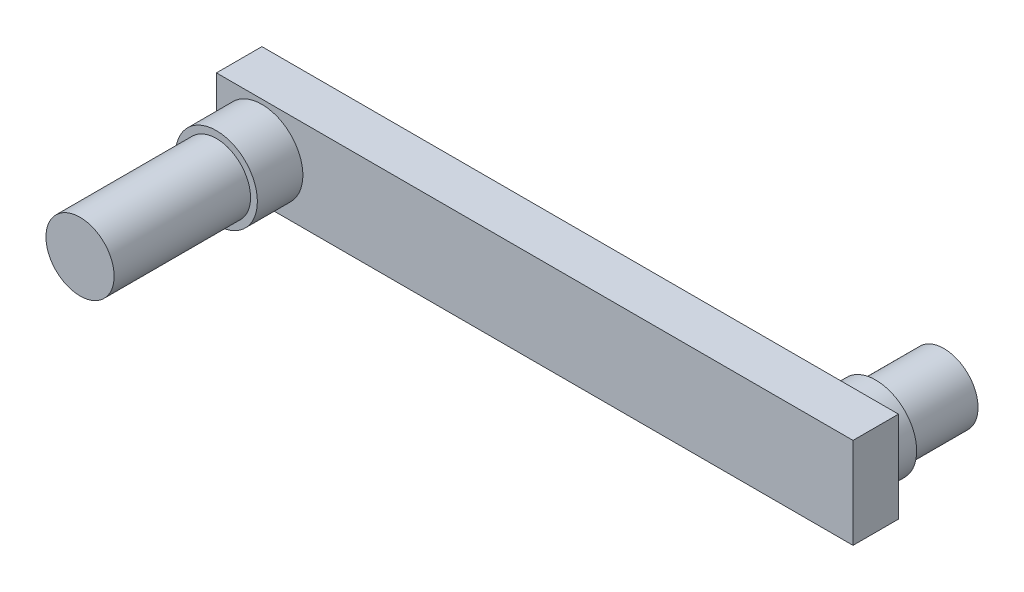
from build123d import *

# Parameters (mm, degrees)
SKETCH_1_W      = 140
SKETCH_1_H      = 20
EXTRUDE_1_DEPTH = 10
SKETCH_2_R      = 9
EXTRUDE_2_DEPTH = 10
SKETCH_4_R      = 7.5
EXTRUDE_3_DEPTH = 30
SKETCH_5_R      = 9
EXTRUDE_4_DEPTH = 5
SKETCH_6_R      = 7.5
EXTRUDE_5_DEPTH = 15


with BuildPart() as part:
    # Sketch 1 → Extrude 1 (new body)
    with BuildSketch(Plane.XY):
        with Locations((70, 10)):
            Rectangle(SKETCH_1_W, SKETCH_1_H)
    extrude(amount=EXTRUDE_1_DEPTH)

    # Sketch 2 → Extrude 2 (add)
    with BuildSketch(Plane.XY.offset(10)):
        with Locations(Location((10, 10, 0), (0, 0, 180))):
            Circle(SKETCH_2_R)
    extrude(amount=EXTRUDE_2_DEPTH)

    # Sketch 4 → Extrude 3 (add)
    with BuildSketch(Plane.XY.offset(20)):
        with Locations((10, 10)):
            Circle(SKETCH_4_R)
    extrude(amount=EXTRUDE_3_DEPTH)

    # Sketch 5 → Extrude 4 (add)
    with BuildSketch(Plane(origin=(0, 0, 0), x_dir=(-1, 0, 0), z_dir=(0, 0, -1))):
        with Locations((-130, 10)):
            Circle(SKETCH_5_R)
    extrude(amount=EXTRUDE_4_DEPTH)

    # Sketch 6 → Extrude 5 (add)
    with BuildSketch(Plane(origin=(0, 0, -5), x_dir=(-1, 0, 0), z_dir=(0, 0, -1))):
        with Locations((-130, 10)):
            Circle(SKETCH_6_R)
    extrude(amount=EXTRUDE_5_DEPTH)


solid = part.part
